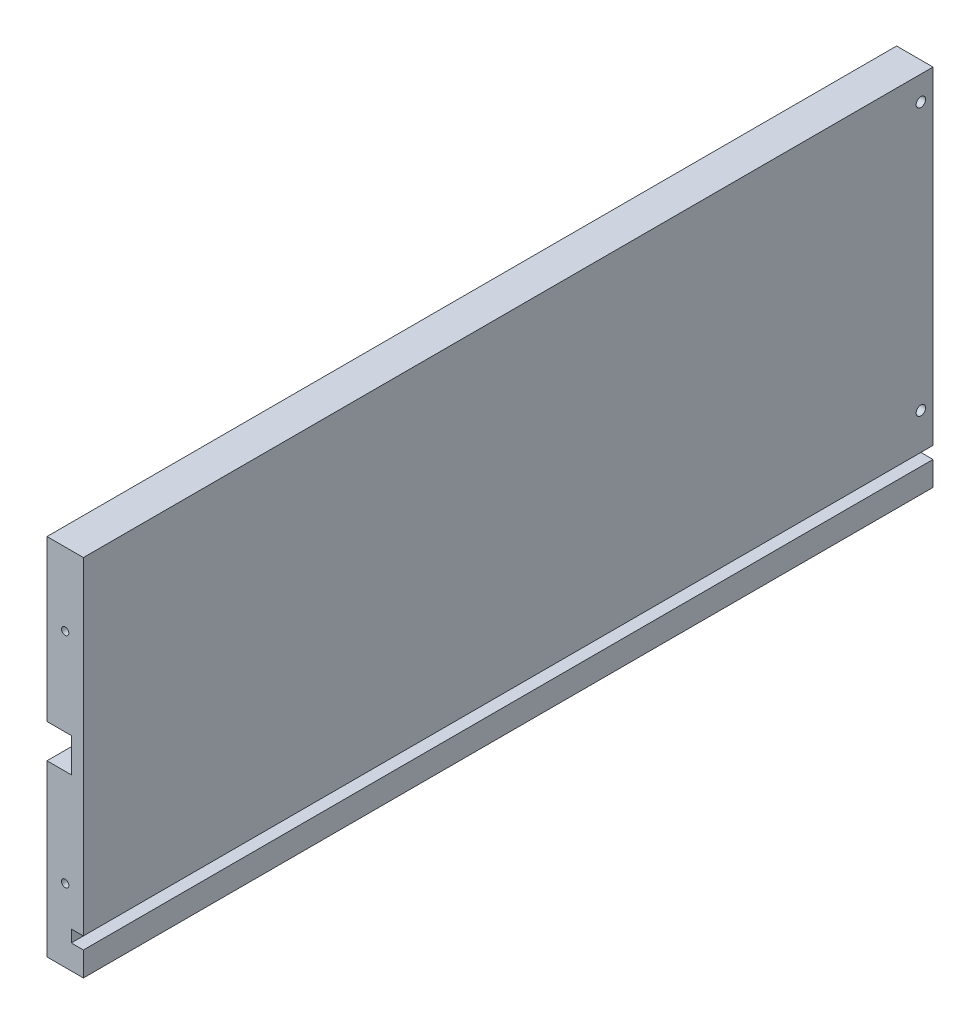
ISO-10303-21;
HEADER;
FILE_DESCRIPTION(('STEP AP214'),'2;1');
FILE_NAME('part.step','',(''),(''),'','','');
FILE_SCHEMA(('AUTOMOTIVE_DESIGN { 1 0 10303 214 1 1 1 1 }'));
ENDSEC;
DATA;
#1=APPLICATION_CONTEXT('core data for automotive mechanical design processes');
#2=APPLICATION_PROTOCOL_DEFINITION('international standard','automotive_design',2000,#1);
#3=PRODUCT_CONTEXT('',#1,'mechanical');
#4=PRODUCT('Part','Part','',(#3));
#5=PRODUCT_RELATED_PRODUCT_CATEGORY('part','',(#4));
#6=PRODUCT_DEFINITION_FORMATION('','',#4);
#7=PRODUCT_DEFINITION_CONTEXT('part definition',#1,'design');
#8=PRODUCT_DEFINITION('design','',#6,#7);
#9=PRODUCT_DEFINITION_SHAPE('','',#8);
#10=(LENGTH_UNIT() NAMED_UNIT(*) SI_UNIT(.MILLI.,.METRE.));
#11=(NAMED_UNIT(*) PLANE_ANGLE_UNIT() SI_UNIT($,.RADIAN.));
#12=(NAMED_UNIT(*) SI_UNIT($,.STERADIAN.) SOLID_ANGLE_UNIT());
#13=UNCERTAINTY_MEASURE_WITH_UNIT(LENGTH_MEASURE(1.E-05),#10,'distance_accuracy_value','');
#14=(GEOMETRIC_REPRESENTATION_CONTEXT(3) GLOBAL_UNCERTAINTY_ASSIGNED_CONTEXT((#13)) GLOBAL_UNIT_ASSIGNED_CONTEXT((#10,
#11,#12)) REPRESENTATION_CONTEXT('',''));
#15=CARTESIAN_POINT('',(0.,0.,0.));
#16=DIRECTION('',(0.,0.,1.));
#17=DIRECTION('',(1.,0.,0.));
#18=AXIS2_PLACEMENT_3D('',#15,#16,#17);
#19=CARTESIAN_POINT('',(15.,150.,0.));
#20=DIRECTION('',(1.,0.,0.));
#21=DIRECTION('',(0.,0.,1.));
#22=AXIS2_PLACEMENT_3D('',#19,#20,#21);
#23=PLANE('',#22);
#24=CARTESIAN_POINT('',(15.,30.,-345.));
#25=DIRECTION('',(1.,0.,0.));
#26=DIRECTION('',(0.,0.,-1.));
#27=AXIS2_PLACEMENT_3D('',#24,#25,#26);
#28=CIRCLE('',#27,1.94999999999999);
#29=CARTESIAN_POINT('',(15.,30.,-346.95));
#30=VERTEX_POINT('',#29);
#31=EDGE_CURVE('E154',#30,#30,#28,.T.);
#32=ORIENTED_EDGE('',*,*,#31,.F.);
#33=EDGE_LOOP('',(#32));
#34=FACE_BOUND('',#33,.T.);
#35=DIRECTION('',(0.,0.,1.));
#36=VECTOR('',#35,1.);
#37=CARTESIAN_POINT('',(15.,15.,-350.));
#38=LINE('',#37,#36);
#39=CARTESIAN_POINT('',(15.,15.,-350.));
#40=VERTEX_POINT('',#39);
#41=CARTESIAN_POINT('',(15.,15.,0.));
#42=VERTEX_POINT('',#41);
#43=EDGE_CURVE('E178',#40,#42,#38,.T.);
#44=ORIENTED_EDGE('',*,*,#43,.F.);
#45=DIRECTION('',(0.,1.,0.));
#46=VECTOR('',#45,1.);
#47=CARTESIAN_POINT('',(15.,0.,-350.));
#48=LINE('',#47,#46);
#49=CARTESIAN_POINT('',(15.,150.,-350.));
#50=VERTEX_POINT('',#49);
#51=EDGE_CURVE('E228',#40,#50,#48,.T.);
#52=ORIENTED_EDGE('',*,*,#51,.T.);
#53=DIRECTION('',(0.,0.,1.));
#54=VECTOR('',#53,1.);
#55=CARTESIAN_POINT('',(15.,150.,0.));
#56=LINE('',#55,#54);
#57=CARTESIAN_POINT('',(15.,150.,0.));
#58=VERTEX_POINT('',#57);
#59=EDGE_CURVE('E231',#50,#58,#56,.T.);
#60=ORIENTED_EDGE('',*,*,#59,.T.);
#61=DIRECTION('',(0.,-1.,0.));
#62=VECTOR('',#61,1.);
#63=CARTESIAN_POINT('',(15.,0.,0.));
#64=LINE('',#63,#62);
#65=EDGE_CURVE('E223',#58,#42,#64,.T.);
#66=ORIENTED_EDGE('',*,*,#65,.T.);
#67=EDGE_LOOP('',(#44,#52,#60,#66));
#68=FACE_BOUND('',#67,.T.);
#69=CARTESIAN_POINT('',(15.,140.,-345.));
#70=DIRECTION('',(1.,0.,0.));
#71=DIRECTION('',(0.,0.,-1.));
#72=AXIS2_PLACEMENT_3D('',#69,#70,#71);
#73=CIRCLE('',#72,1.95000000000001);
#74=CARTESIAN_POINT('',(15.,140.,-346.95));
#75=VERTEX_POINT('',#74);
#76=EDGE_CURVE('E145',#75,#75,#73,.T.);
#77=ORIENTED_EDGE('',*,*,#76,.F.);
#78=EDGE_LOOP('',(#77));
#79=FACE_BOUND('',#78,.T.);
#80=ADVANCED_FACE('F28',(#34,#68,#79),#23,.T.);
#81=CARTESIAN_POINT('',(0.,150.,0.));
#82=DIRECTION('',(1.,0.,0.));
#83=DIRECTION('',(0.,0.,1.));
#84=AXIS2_PLACEMENT_3D('',#81,#82,#83);
#85=PLANE('',#84);
#86=CARTESIAN_POINT('',(0.,30.,-345.));
#87=DIRECTION('',(1.,0.,0.));
#88=DIRECTION('',(0.,0.,-1.));
#89=AXIS2_PLACEMENT_3D('',#86,#87,#88);
#90=CIRCLE('',#89,4.1);
#91=CARTESIAN_POINT('',(0.,30.,-349.1));
#92=VERTEX_POINT('',#91);
#93=EDGE_CURVE('E160',#92,#92,#90,.T.);
#94=ORIENTED_EDGE('',*,*,#93,.T.);
#95=EDGE_LOOP('',(#94));
#96=FACE_BOUND('',#95,.T.);
#97=DIRECTION('',(0.,1.,0.));
#98=VECTOR('',#97,1.);
#99=CARTESIAN_POINT('',(0.,0.,-350.));
#100=LINE('',#99,#98);
#101=CARTESIAN_POINT('',(0.,0.,-350.));
#102=VERTEX_POINT('',#101);
#103=CARTESIAN_POINT('',(0.,70.,-350.));
#104=VERTEX_POINT('',#103);
#105=EDGE_CURVE('E217',#102,#104,#100,.T.);
#106=ORIENTED_EDGE('',*,*,#105,.F.);
#107=DIRECTION('',(0.,0.,-1.));
#108=VECTOR('',#107,1.);
#109=CARTESIAN_POINT('',(0.,0.,0.));
#110=LINE('',#109,#108);
#111=CARTESIAN_POINT('',(0.,0.,0.));
#112=VERTEX_POINT('',#111);
#113=EDGE_CURVE('E213',#112,#102,#110,.T.);
#114=ORIENTED_EDGE('',*,*,#113,.F.);
#115=DIRECTION('',(0.,-1.,0.));
#116=VECTOR('',#115,1.);
#117=CARTESIAN_POINT('',(0.,0.,0.));
#118=LINE('',#117,#116);
#119=CARTESIAN_POINT('',(0.,70.,0.));
#120=VERTEX_POINT('',#119);
#121=EDGE_CURVE('E204',#120,#112,#118,.T.);
#122=ORIENTED_EDGE('',*,*,#121,.F.);
#123=DIRECTION('',(0.,0.,1.));
#124=VECTOR('',#123,1.);
#125=CARTESIAN_POINT('',(0.,70.,-350.));
#126=LINE('',#125,#124);
#127=EDGE_CURVE('E201',#104,#120,#126,.T.);
#128=ORIENTED_EDGE('',*,*,#127,.F.);
#129=EDGE_LOOP('',(#106,#114,#122,#128));
#130=FACE_BOUND('',#129,.T.);
#131=ADVANCED_FACE('F252',(#96,#130),#85,.F.);
#132=CARTESIAN_POINT('',(15.,0.,0.));
#133=DIRECTION('',(0.,0.,1.));
#134=DIRECTION('',(-1.,0.,0.));
#135=AXIS2_PLACEMENT_3D('',#132,#133,#134);
#136=PLANE('',#135);
#137=CARTESIAN_POINT('',(7.5,30.,0.));
#138=DIRECTION('',(0.,0.,-1.));
#139=DIRECTION('',(-1.,0.,0.));
#140=AXIS2_PLACEMENT_3D('',#137,#138,#139);
#141=CIRCLE('',#140,1.5);
#142=CARTESIAN_POINT('',(6.00000000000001,30.,0.));
#143=VERTEX_POINT('',#142);
#144=EDGE_CURVE('E134',#143,#143,#141,.T.);
#145=ORIENTED_EDGE('',*,*,#144,.T.);
#146=EDGE_LOOP('',(#145));
#147=FACE_BOUND('',#146,.T.);
#148=CARTESIAN_POINT('',(7.50000000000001,120.,0.));
#149=DIRECTION('',(0.,0.,-1.));
#150=DIRECTION('',(-1.,0.,0.));
#151=AXIS2_PLACEMENT_3D('',#148,#149,#150);
#152=CIRCLE('',#151,1.5);
#153=CARTESIAN_POINT('',(6.00000000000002,120.,0.));
#154=VERTEX_POINT('',#153);
#155=EDGE_CURVE('E142',#154,#154,#152,.T.);
#156=ORIENTED_EDGE('',*,*,#155,.T.);
#157=EDGE_LOOP('',(#156));
#158=FACE_BOUND('',#157,.T.);
#159=DIRECTION('',(1.,0.,0.));
#160=VECTOR('',#159,1.);
#161=CARTESIAN_POINT('',(15.,15.,0.));
#162=LINE('',#161,#160);
#163=CARTESIAN_POINT('',(10.,15.,0.));
#164=VERTEX_POINT('',#163);
#165=EDGE_CURVE('E169',#164,#42,#162,.T.);
#166=ORIENTED_EDGE('',*,*,#165,.T.);
#167=ORIENTED_EDGE('',*,*,#65,.F.);
#168=DIRECTION('',(-1.,0.,0.));
#169=VECTOR('',#168,1.);
#170=CARTESIAN_POINT('',(15.,150.,0.));
#171=LINE('',#170,#169);
#172=CARTESIAN_POINT('',(0.,150.,0.));
#173=VERTEX_POINT('',#172);
#174=EDGE_CURVE('E11',#58,#173,#171,.T.);
#175=ORIENTED_EDGE('',*,*,#174,.T.);
#176=CARTESIAN_POINT('',(0.,84.,0.));
#177=VERTEX_POINT('',#176);
#178=EDGE_CURVE('E210',#173,#177,#118,.T.);
#179=ORIENTED_EDGE('',*,*,#178,.T.);
#180=DIRECTION('',(1.,0.,0.));
#181=VECTOR('',#180,1.);
#182=CARTESIAN_POINT('',(0.,84.,0.));
#183=LINE('',#182,#181);
#184=CARTESIAN_POINT('',(10.,84.,0.));
#185=VERTEX_POINT('',#184);
#186=EDGE_CURVE('E181',#177,#185,#183,.T.);
#187=ORIENTED_EDGE('',*,*,#186,.T.);
#188=DIRECTION('',(0.,-1.,0.));
#189=VECTOR('',#188,1.);
#190=CARTESIAN_POINT('',(10.,70.,0.));
#191=LINE('',#190,#189);
#192=CARTESIAN_POINT('',(10.,70.,0.));
#193=VERTEX_POINT('',#192);
#194=EDGE_CURVE('E189',#185,#193,#191,.T.);
#195=ORIENTED_EDGE('',*,*,#194,.T.);
#196=DIRECTION('',(-1.,0.,0.));
#197=VECTOR('',#196,1.);
#198=CARTESIAN_POINT('',(0.,70.,0.));
#199=LINE('',#198,#197);
#200=EDGE_CURVE('E192',#193,#120,#199,.T.);
#201=ORIENTED_EDGE('',*,*,#200,.T.);
#202=ORIENTED_EDGE('',*,*,#121,.T.);
#203=DIRECTION('',(-1.,0.,0.));
#204=VECTOR('',#203,1.);
#205=CARTESIAN_POINT('',(15.,0.,0.));
#206=LINE('',#205,#204);
#207=CARTESIAN_POINT('',(15.,0.,0.));
#208=VERTEX_POINT('',#207);
#209=EDGE_CURVE('E32',#208,#112,#206,.T.);
#210=ORIENTED_EDGE('',*,*,#209,.F.);
#211=CARTESIAN_POINT('',(15.,10.,0.));
#212=VERTEX_POINT('',#211);
#213=EDGE_CURVE('E222',#212,#208,#64,.T.);
#214=ORIENTED_EDGE('',*,*,#213,.F.);
#215=DIRECTION('',(-1.,0.,0.));
#216=VECTOR('',#215,1.);
#217=CARTESIAN_POINT('',(15.,10.,0.));
#218=LINE('',#217,#216);
#219=CARTESIAN_POINT('',(10.,10.,0.));
#220=VERTEX_POINT('',#219);
#221=EDGE_CURVE('E163',#212,#220,#218,.T.);
#222=ORIENTED_EDGE('',*,*,#221,.T.);
#223=DIRECTION('',(0.,1.,0.));
#224=VECTOR('',#223,1.);
#225=CARTESIAN_POINT('',(10.,10.,0.));
#226=LINE('',#225,#224);
#227=EDGE_CURVE('E166',#220,#164,#226,.T.);
#228=ORIENTED_EDGE('',*,*,#227,.T.);
#229=EDGE_LOOP('',(#166,#167,#175,#179,#187,#195,#201,#202,#210,#214,#222,#228));
#230=FACE_BOUND('',#229,.T.);
#231=ADVANCED_FACE('F30',(#147,#158,#230),#136,.T.);
#232=CARTESIAN_POINT('',(15.,150.,0.));
#233=DIRECTION('',(0.,1.,0.));
#234=DIRECTION('',(0.,0.,1.));
#235=AXIS2_PLACEMENT_3D('',#232,#233,#234);
#236=PLANE('',#235);
#237=DIRECTION('',(0.,0.,1.));
#238=VECTOR('',#237,1.);
#239=CARTESIAN_POINT('',(0.,150.,0.));
#240=LINE('',#239,#238);
#241=CARTESIAN_POINT('',(0.,150.,-350.));
#242=VERTEX_POINT('',#241);
#243=EDGE_CURVE('E220',#242,#173,#240,.T.);
#244=ORIENTED_EDGE('',*,*,#243,.T.);
#245=ORIENTED_EDGE('',*,*,#174,.F.);
#246=ORIENTED_EDGE('',*,*,#59,.F.);
#247=DIRECTION('',(-1.,0.,0.));
#248=VECTOR('',#247,1.);
#249=CARTESIAN_POINT('',(15.,150.,-350.));
#250=LINE('',#249,#248);
#251=EDGE_CURVE('E37',#50,#242,#250,.T.);
#252=ORIENTED_EDGE('',*,*,#251,.T.);
#253=EDGE_LOOP('',(#244,#245,#246,#252));
#254=FACE_BOUND('',#253,.T.);
#255=ADVANCED_FACE('F269',(#254),#236,.T.);
#256=CARTESIAN_POINT('',(15.,0.,-350.));
#257=DIRECTION('',(0.,0.,-1.));
#258=DIRECTION('',(1.,0.,0.));
#259=AXIS2_PLACEMENT_3D('',#256,#257,#258);
#260=PLANE('',#259);
#261=DIRECTION('',(1.,0.,0.));
#262=VECTOR('',#261,1.);
#263=CARTESIAN_POINT('',(15.,15.,-350.));
#264=LINE('',#263,#262);
#265=CARTESIAN_POINT('',(10.,15.,-350.));
#266=VERTEX_POINT('',#265);
#267=EDGE_CURVE('E176',#266,#40,#264,.T.);
#268=ORIENTED_EDGE('',*,*,#267,.F.);
#269=DIRECTION('',(0.,1.,0.));
#270=VECTOR('',#269,1.);
#271=CARTESIAN_POINT('',(10.,10.,-350.));
#272=LINE('',#271,#270);
#273=CARTESIAN_POINT('',(10.,10.,-350.));
#274=VERTEX_POINT('',#273);
#275=EDGE_CURVE('E173',#274,#266,#272,.T.);
#276=ORIENTED_EDGE('',*,*,#275,.F.);
#277=DIRECTION('',(-1.,0.,0.));
#278=VECTOR('',#277,1.);
#279=CARTESIAN_POINT('',(15.,10.,-350.));
#280=LINE('',#279,#278);
#281=CARTESIAN_POINT('',(15.,10.,-350.));
#282=VERTEX_POINT('',#281);
#283=EDGE_CURVE('E171',#282,#274,#280,.T.);
#284=ORIENTED_EDGE('',*,*,#283,.F.);
#285=CARTESIAN_POINT('',(15.,0.,-350.));
#286=VERTEX_POINT('',#285);
#287=EDGE_CURVE('E229',#286,#282,#48,.T.);
#288=ORIENTED_EDGE('',*,*,#287,.F.);
#289=DIRECTION('',(-1.,0.,0.));
#290=VECTOR('',#289,1.);
#291=CARTESIAN_POINT('',(15.,0.,-350.));
#292=LINE('',#291,#290);
#293=EDGE_CURVE('E235',#286,#102,#292,.T.);
#294=ORIENTED_EDGE('',*,*,#293,.T.);
#295=ORIENTED_EDGE('',*,*,#105,.T.);
#296=DIRECTION('',(-1.,0.,0.));
#297=VECTOR('',#296,1.);
#298=CARTESIAN_POINT('',(0.,70.,-350.));
#299=LINE('',#298,#297);
#300=CARTESIAN_POINT('',(10.,70.,-350.));
#301=VERTEX_POINT('',#300);
#302=EDGE_CURVE('E199',#301,#104,#299,.T.);
#303=ORIENTED_EDGE('',*,*,#302,.F.);
#304=DIRECTION('',(0.,-1.,0.));
#305=VECTOR('',#304,1.);
#306=CARTESIAN_POINT('',(10.,70.,-350.));
#307=LINE('',#306,#305);
#308=CARTESIAN_POINT('',(10.,84.,-350.));
#309=VERTEX_POINT('',#308);
#310=EDGE_CURVE('E196',#309,#301,#307,.T.);
#311=ORIENTED_EDGE('',*,*,#310,.F.);
#312=DIRECTION('',(1.,0.,0.));
#313=VECTOR('',#312,1.);
#314=CARTESIAN_POINT('',(0.,84.,-350.));
#315=LINE('',#314,#313);
#316=CARTESIAN_POINT('',(0.,84.,-350.));
#317=VERTEX_POINT('',#316);
#318=EDGE_CURVE('E194',#317,#309,#315,.T.);
#319=ORIENTED_EDGE('',*,*,#318,.F.);
#320=EDGE_CURVE('E216',#317,#242,#100,.T.);
#321=ORIENTED_EDGE('',*,*,#320,.T.);
#322=ORIENTED_EDGE('',*,*,#251,.F.);
#323=ORIENTED_EDGE('',*,*,#51,.F.);
#324=EDGE_LOOP('',(#268,#276,#284,#288,#294,#295,#303,#311,#319,#321,#322,#323));
#325=FACE_BOUND('',#324,.T.);
#326=ADVANCED_FACE('F255',(#325),#260,.T.);
#327=CARTESIAN_POINT('',(15.,0.,0.));
#328=DIRECTION('',(0.,-1.,0.));
#329=DIRECTION('',(0.,0.,-1.));
#330=AXIS2_PLACEMENT_3D('',#327,#328,#329);
#331=PLANE('',#330);
#332=ORIENTED_EDGE('',*,*,#113,.T.);
#333=ORIENTED_EDGE('',*,*,#293,.F.);
#334=DIRECTION('',(0.,0.,-1.));
#335=VECTOR('',#334,1.);
#336=CARTESIAN_POINT('',(15.,0.,0.));
#337=LINE('',#336,#335);
#338=EDGE_CURVE('E226',#208,#286,#337,.T.);
#339=ORIENTED_EDGE('',*,*,#338,.F.);
#340=ORIENTED_EDGE('',*,*,#209,.T.);
#341=EDGE_LOOP('',(#332,#333,#339,#340));
#342=FACE_BOUND('',#341,.T.);
#343=ADVANCED_FACE('F242',(#342),#331,.T.);
#344=DIRECTION('',(0.,0.,1.));
#345=VECTOR('',#344,1.);
#346=CARTESIAN_POINT('',(15.,10.,-350.));
#347=LINE('',#346,#345);
#348=EDGE_CURVE('E45',#282,#212,#347,.T.);
#349=ORIENTED_EDGE('',*,*,#348,.T.);
#350=ORIENTED_EDGE('',*,*,#213,.T.);
#351=ORIENTED_EDGE('',*,*,#338,.T.);
#352=ORIENTED_EDGE('',*,*,#287,.T.);
#353=EDGE_LOOP('',(#349,#350,#351,#352));
#354=FACE_BOUND('',#353,.T.);
#355=ADVANCED_FACE('F287',(#354),#23,.T.);
#356=CARTESIAN_POINT('',(0.,140.,-345.));
#357=DIRECTION('',(1.,0.,0.));
#358=DIRECTION('',(0.,0.,-1.));
#359=AXIS2_PLACEMENT_3D('',#356,#357,#358);
#360=CIRCLE('',#359,4.09999999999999);
#361=CARTESIAN_POINT('',(0.,140.,-349.1));
#362=VERTEX_POINT('',#361);
#363=EDGE_CURVE('E151',#362,#362,#360,.T.);
#364=ORIENTED_EDGE('',*,*,#363,.T.);
#365=EDGE_LOOP('',(#364));
#366=FACE_BOUND('',#365,.T.);
#367=ORIENTED_EDGE('',*,*,#178,.F.);
#368=ORIENTED_EDGE('',*,*,#243,.F.);
#369=ORIENTED_EDGE('',*,*,#320,.F.);
#370=DIRECTION('',(0.,0.,1.));
#371=VECTOR('',#370,1.);
#372=CARTESIAN_POINT('',(0.,84.,-350.));
#373=LINE('',#372,#371);
#374=EDGE_CURVE('E53',#317,#177,#373,.T.);
#375=ORIENTED_EDGE('',*,*,#374,.T.);
#376=EDGE_LOOP('',(#367,#368,#369,#375));
#377=FACE_BOUND('',#376,.T.);
#378=ADVANCED_FACE('F272',(#366,#377),#85,.F.);
#379=CARTESIAN_POINT('',(0.,70.,-350.));
#380=DIRECTION('',(0.,-1.,0.));
#381=DIRECTION('',(0.,0.,-1.));
#382=AXIS2_PLACEMENT_3D('',#379,#380,#381);
#383=PLANE('',#382);
#384=ORIENTED_EDGE('',*,*,#200,.F.);
#385=DIRECTION('',(0.,0.,1.));
#386=VECTOR('',#385,1.);
#387=CARTESIAN_POINT('',(10.,70.,-350.));
#388=LINE('',#387,#386);
#389=EDGE_CURVE('E205',#301,#193,#388,.T.);
#390=ORIENTED_EDGE('',*,*,#389,.F.);
#391=ORIENTED_EDGE('',*,*,#302,.T.);
#392=ORIENTED_EDGE('',*,*,#127,.T.);
#393=EDGE_LOOP('',(#384,#390,#391,#392));
#394=FACE_BOUND('',#393,.T.);
#395=ADVANCED_FACE('F259',(#394),#383,.F.);
#396=CARTESIAN_POINT('',(10.,70.,-350.));
#397=DIRECTION('',(1.,0.,0.));
#398=DIRECTION('',(0.,0.,1.));
#399=AXIS2_PLACEMENT_3D('',#396,#397,#398);
#400=PLANE('',#399);
#401=ORIENTED_EDGE('',*,*,#194,.F.);
#402=DIRECTION('',(0.,0.,1.));
#403=VECTOR('',#402,1.);
#404=CARTESIAN_POINT('',(10.,84.,-350.));
#405=LINE('',#404,#403);
#406=EDGE_CURVE('E207',#309,#185,#405,.T.);
#407=ORIENTED_EDGE('',*,*,#406,.F.);
#408=ORIENTED_EDGE('',*,*,#310,.T.);
#409=ORIENTED_EDGE('',*,*,#389,.T.);
#410=EDGE_LOOP('',(#401,#407,#408,#409));
#411=FACE_BOUND('',#410,.T.);
#412=ADVANCED_FACE('F262',(#411),#400,.F.);
#413=CARTESIAN_POINT('',(0.,84.,-350.));
#414=DIRECTION('',(0.,1.,0.));
#415=DIRECTION('',(0.,0.,1.));
#416=AXIS2_PLACEMENT_3D('',#413,#414,#415);
#417=PLANE('',#416);
#418=ORIENTED_EDGE('',*,*,#186,.F.);
#419=ORIENTED_EDGE('',*,*,#374,.F.);
#420=ORIENTED_EDGE('',*,*,#318,.T.);
#421=ORIENTED_EDGE('',*,*,#406,.T.);
#422=EDGE_LOOP('',(#418,#419,#420,#421));
#423=FACE_BOUND('',#422,.T.);
#424=ADVANCED_FACE('F263',(#423),#417,.F.);
#425=CARTESIAN_POINT('',(15.,15.,-350.));
#426=DIRECTION('',(0.,1.,0.));
#427=DIRECTION('',(0.,0.,1.));
#428=AXIS2_PLACEMENT_3D('',#425,#426,#427);
#429=PLANE('',#428);
#430=ORIENTED_EDGE('',*,*,#165,.F.);
#431=DIRECTION('',(0.,0.,1.));
#432=VECTOR('',#431,1.);
#433=CARTESIAN_POINT('',(10.,15.,-350.));
#434=LINE('',#433,#432);
#435=EDGE_CURVE('E182',#266,#164,#434,.T.);
#436=ORIENTED_EDGE('',*,*,#435,.F.);
#437=ORIENTED_EDGE('',*,*,#267,.T.);
#438=ORIENTED_EDGE('',*,*,#43,.T.);
#439=EDGE_LOOP('',(#430,#436,#437,#438));
#440=FACE_BOUND('',#439,.T.);
#441=ADVANCED_FACE('F281',(#440),#429,.F.);
#442=CARTESIAN_POINT('',(10.,10.,-350.));
#443=DIRECTION('',(-1.,0.,0.));
#444=DIRECTION('',(0.,0.,-1.));
#445=AXIS2_PLACEMENT_3D('',#442,#443,#444);
#446=PLANE('',#445);
#447=ORIENTED_EDGE('',*,*,#227,.F.);
#448=DIRECTION('',(0.,0.,1.));
#449=VECTOR('',#448,1.);
#450=CARTESIAN_POINT('',(10.,10.,-350.));
#451=LINE('',#450,#449);
#452=EDGE_CURVE('E184',#274,#220,#451,.T.);
#453=ORIENTED_EDGE('',*,*,#452,.F.);
#454=ORIENTED_EDGE('',*,*,#275,.T.);
#455=ORIENTED_EDGE('',*,*,#435,.T.);
#456=EDGE_LOOP('',(#447,#453,#454,#455));
#457=FACE_BOUND('',#456,.T.);
#458=ADVANCED_FACE('F284',(#457),#446,.F.);
#459=CARTESIAN_POINT('',(15.,10.,-350.));
#460=DIRECTION('',(0.,-1.,0.));
#461=DIRECTION('',(-1.,0.,0.));
#462=AXIS2_PLACEMENT_3D('',#459,#460,#461);
#463=PLANE('',#462);
#464=ORIENTED_EDGE('',*,*,#221,.F.);
#465=ORIENTED_EDGE('',*,*,#348,.F.);
#466=ORIENTED_EDGE('',*,*,#283,.T.);
#467=ORIENTED_EDGE('',*,*,#452,.T.);
#468=EDGE_LOOP('',(#464,#465,#466,#467));
#469=FACE_BOUND('',#468,.T.);
#470=ADVANCED_FACE('F285',(#469),#463,.F.);
#471=CARTESIAN_POINT('',(0.,30.,-345.));
#472=DIRECTION('',(-1.,0.,0.));
#473=DIRECTION('',(0.,0.,-1.));
#474=AXIS2_PLACEMENT_3D('',#471,#472,#473);
#475=CONICAL_SURFACE('',#474,4.1,0.785398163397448);
#476=CARTESIAN_POINT('',(2.15,30.,-345.));
#477=DIRECTION('',(1.,0.,0.));
#478=DIRECTION('',(0.,0.,-1.));
#479=AXIS2_PLACEMENT_3D('',#476,#477,#478);
#480=CIRCLE('',#479,1.95);
#481=CARTESIAN_POINT('',(2.15,30.,-346.95));
#482=VERTEX_POINT('',#481);
#483=EDGE_CURVE('E157',#482,#482,#480,.T.);
#484=ORIENTED_EDGE('',*,*,#483,.T.);
#485=EDGE_LOOP('',(#484));
#486=FACE_BOUND('',#485,.T.);
#487=ORIENTED_EDGE('',*,*,#93,.F.);
#488=EDGE_LOOP('',(#487));
#489=FACE_BOUND('',#488,.T.);
#490=ADVANCED_FACE('F309',(#486,#489),#475,.F.);
#491=CARTESIAN_POINT('',(0.,30.,-345.));
#492=DIRECTION('',(-1.,0.,0.));
#493=DIRECTION('',(0.,0.,-1.));
#494=AXIS2_PLACEMENT_3D('',#491,#492,#493);
#495=CYLINDRICAL_SURFACE('',#494,1.95);
#496=ORIENTED_EDGE('',*,*,#31,.T.);
#497=EDGE_LOOP('',(#496));
#498=FACE_BOUND('',#497,.T.);
#499=ORIENTED_EDGE('',*,*,#483,.F.);
#500=EDGE_LOOP('',(#499));
#501=FACE_BOUND('',#500,.T.);
#502=ADVANCED_FACE('F305',(#498,#501),#495,.F.);
#503=CARTESIAN_POINT('',(0.,140.,-345.));
#504=DIRECTION('',(-1.,0.,0.));
#505=DIRECTION('',(0.,0.,-1.));
#506=AXIS2_PLACEMENT_3D('',#503,#504,#505);
#507=CONICAL_SURFACE('',#506,4.09999999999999,0.785398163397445);
#508=CARTESIAN_POINT('',(2.15,140.,-345.));
#509=DIRECTION('',(1.,0.,0.));
#510=DIRECTION('',(0.,0.,-1.));
#511=AXIS2_PLACEMENT_3D('',#508,#509,#510);
#512=CIRCLE('',#511,1.95000000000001);
#513=CARTESIAN_POINT('',(2.15,140.,-346.95));
#514=VERTEX_POINT('',#513);
#515=EDGE_CURVE('E148',#514,#514,#512,.T.);
#516=ORIENTED_EDGE('',*,*,#515,.T.);
#517=EDGE_LOOP('',(#516));
#518=FACE_BOUND('',#517,.T.);
#519=ORIENTED_EDGE('',*,*,#363,.F.);
#520=EDGE_LOOP('',(#519));
#521=FACE_BOUND('',#520,.T.);
#522=ADVANCED_FACE('F308',(#518,#521),#507,.F.);
#523=CARTESIAN_POINT('',(0.,140.,-345.));
#524=DIRECTION('',(-1.,0.,0.));
#525=DIRECTION('',(0.,0.,-1.));
#526=AXIS2_PLACEMENT_3D('',#523,#524,#525);
#527=CYLINDRICAL_SURFACE('',#526,1.95000000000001);
#528=ORIENTED_EDGE('',*,*,#76,.T.);
#529=EDGE_LOOP('',(#528));
#530=FACE_BOUND('',#529,.T.);
#531=ORIENTED_EDGE('',*,*,#515,.F.);
#532=EDGE_LOOP('',(#531));
#533=FACE_BOUND('',#532,.T.);
#534=ADVANCED_FACE('F361',(#530,#533),#527,.F.);
#535=CARTESIAN_POINT('',(7.50000000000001,120.,0.));
#536=DIRECTION('',(0.,0.,1.));
#537=DIRECTION('',(-1.,0.,0.));
#538=AXIS2_PLACEMENT_3D('',#535,#536,#537);
#539=CYLINDRICAL_SURFACE('',#538,1.5);
#540=CARTESIAN_POINT('',(7.50000000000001,120.,-10.));
#541=DIRECTION('',(0.,0.,-1.));
#542=DIRECTION('',(-1.,0.,0.));
#543=AXIS2_PLACEMENT_3D('',#540,#541,#542);
#544=CIRCLE('',#543,1.5);
#545=CARTESIAN_POINT('',(6.00000000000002,120.,-10.));
#546=VERTEX_POINT('',#545);
#547=EDGE_CURVE('E137',#546,#546,#544,.T.);
#548=ORIENTED_EDGE('',*,*,#547,.T.);
#549=EDGE_LOOP('',(#548));
#550=FACE_BOUND('',#549,.T.);
#551=ORIENTED_EDGE('',*,*,#155,.F.);
#552=EDGE_LOOP('',(#551));
#553=FACE_BOUND('',#552,.T.);
#554=ADVANCED_FACE('F368',(#550,#553),#539,.F.);
#555=CARTESIAN_POINT('',(7.50000000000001,120.,-10.));
#556=DIRECTION('',(0.,0.,1.));
#557=DIRECTION('',(-1.,0.,0.));
#558=AXIS2_PLACEMENT_3D('',#555,#556,#557);
#559=CONICAL_SURFACE('',#558,1.5,1.02974425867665);
#560=CARTESIAN_POINT('',(7.50000000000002,120.,-10.9012909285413));
#561=VERTEX_POINT('',#560);
#562=VERTEX_LOOP('',#561);
#563=FACE_BOUND('',#562,.T.);
#564=ORIENTED_EDGE('',*,*,#547,.F.);
#565=EDGE_LOOP('',(#564));
#566=FACE_BOUND('',#565,.T.);
#567=ADVANCED_FACE('F376',(#563,#566),#559,.F.);
#568=CARTESIAN_POINT('',(7.5,30.,0.));
#569=DIRECTION('',(0.,0.,1.));
#570=DIRECTION('',(-1.,0.,0.));
#571=AXIS2_PLACEMENT_3D('',#568,#569,#570);
#572=CYLINDRICAL_SURFACE('',#571,1.5);
#573=CARTESIAN_POINT('',(7.5,30.,-10.));
#574=DIRECTION('',(0.,0.,-1.));
#575=DIRECTION('',(-1.,0.,0.));
#576=AXIS2_PLACEMENT_3D('',#573,#574,#575);
#577=CIRCLE('',#576,1.5);
#578=CARTESIAN_POINT('',(6.00000000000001,30.,-10.));
#579=VERTEX_POINT('',#578);
#580=EDGE_CURVE('E132',#579,#579,#577,.T.);
#581=ORIENTED_EDGE('',*,*,#580,.T.);
#582=EDGE_LOOP('',(#581));
#583=FACE_BOUND('',#582,.T.);
#584=ORIENTED_EDGE('',*,*,#144,.F.);
#585=EDGE_LOOP('',(#584));
#586=FACE_BOUND('',#585,.T.);
#587=ADVANCED_FACE('F128',(#583,#586),#572,.F.);
#588=CARTESIAN_POINT('',(7.5,30.,-10.));
#589=DIRECTION('',(0.,0.,1.));
#590=DIRECTION('',(-1.,0.,0.));
#591=AXIS2_PLACEMENT_3D('',#588,#589,#590);
#592=CONICAL_SURFACE('',#591,1.5,1.02974425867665);
#593=CARTESIAN_POINT('',(7.50000000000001,30.,-10.9012909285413));
#594=VERTEX_POINT('',#593);
#595=VERTEX_LOOP('',#594);
#596=FACE_BOUND('',#595,.T.);
#597=ORIENTED_EDGE('',*,*,#580,.F.);
#598=EDGE_LOOP('',(#597));
#599=FACE_BOUND('',#598,.T.);
#600=ADVANCED_FACE('F125',(#596,#599),#592,.F.);
#601=CLOSED_SHELL('',(#80,#131,#231,#255,#326,#343,#355,#378,#395,#412,#424,#441,#458,#470,#490,
#502,#522,#534,#554,#567,#587,#600));
#602=MANIFOLD_SOLID_BREP('B2',#601);
#603=ADVANCED_BREP_SHAPE_REPRESENTATION('',(#18,#602),#14);
#604=SHAPE_DEFINITION_REPRESENTATION(#9,#603);
ENDSEC;
END-ISO-10303-21;
